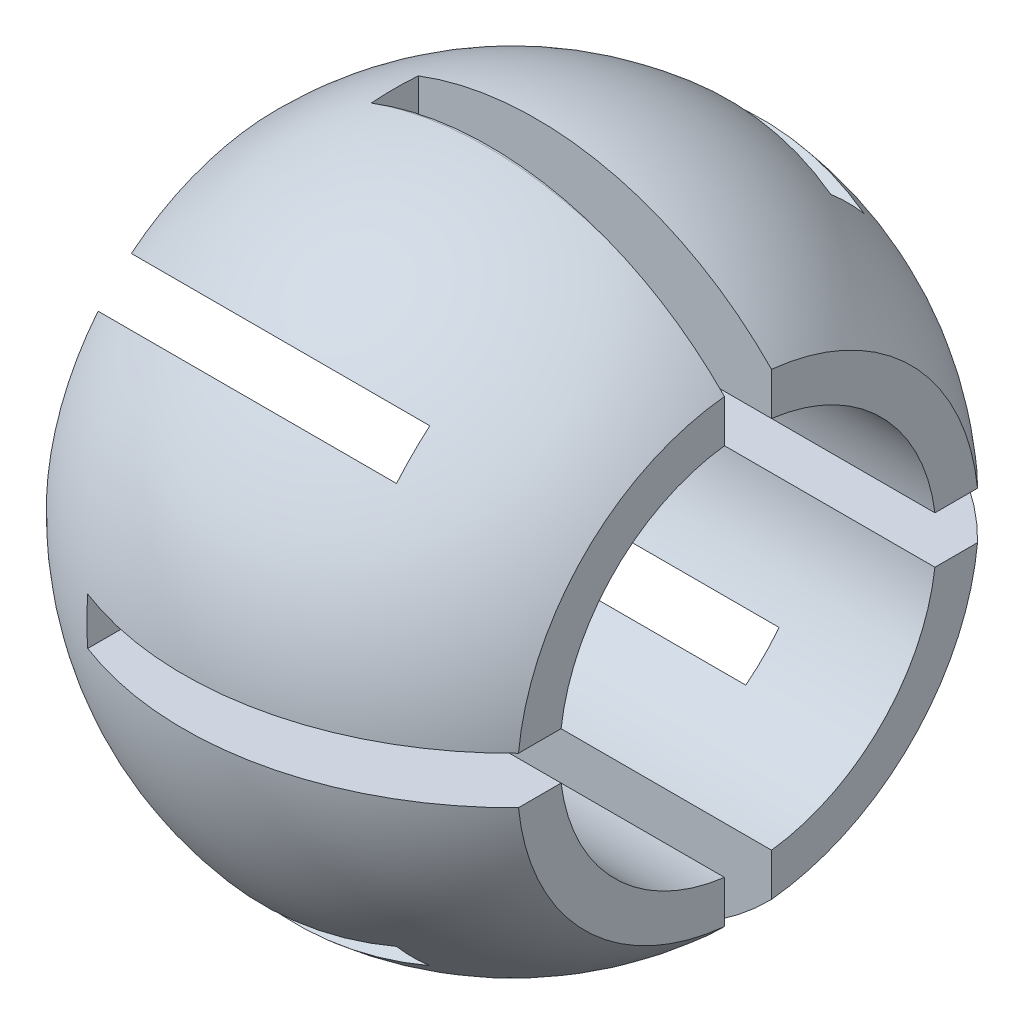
from build123d import *
from build123d.topology import SkipClean

# Parameters (mm, degrees)
SKIZZE2_W               = 7.5
SKIZZE2_H               = 1
LINEAR_AUSTRAGEN1_DEPTH = 12.090536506
KREISMUSTER1_COUNT      = 4
SKIZZE3_W               = 7.5
SKIZZE3_H               = 1
LINEAR_AUSTRAGEN2_DEPTH = 12.067971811
KREISMUSTER2_COUNT      = 4


with BuildPart() as part:
    # Skizze1 → Rotation1 (revolve)
    with BuildSketch(Plane.XY, mode=Mode.PRIVATE) as rotation1_sk:
        with BuildLine():
            Line((-5, 4), (5, 4))
            Line((5, 4), (5, 4.898979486))
            ThreePointArc((5, 4.898979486), (0, 7), (-5, 4.898979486))
            Line((-5, 4.898979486), (-5, 4))
        make_face()
    revolve(rotation1_sk.sketch.rotate(Axis((-5, 0, 0), (1, 0, 0)), 4.385799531), axis=Axis((-5, 0, 0), (1, 0, 0)))

    # Skizze2 → Linear austragen1 (cut, through all)
    with BuildSketch(Plane(origin=(0, 0, 0), x_dir=(1, 0, 0), z_dir=(0, 1, 0))):
        with Locations((1.25, 0)):
            Rectangle(SKIZZE2_W, SKIZZE2_H)
    linear_austragen1 = extrude(amount=-LINEAR_AUSTRAGEN1_DEPTH, mode=Mode.SUBTRACT)

    # Kreismuster1: Linear austragen1 ×4 about axis
    with SkipClean():  # the faces are left unmerged after this step: merging them gives an invalid solid
        kreismuster1_axis = Axis((0, 0, 0), (1, 0, 0))
        for i in range(1, KREISMUSTER1_COUNT):
            add(linear_austragen1.rotate(kreismuster1_axis, i * 360 / KREISMUSTER1_COUNT), mode=Mode.SUBTRACT)

    # Skizze3 → Linear austragen2 (cut, through all)
    with SkipClean():  # the faces are left unmerged after this step: merging them gives an invalid solid
        with BuildSketch(Plane(origin=(0, 0, 0), x_dir=(-1, 0, 0), z_dir=(0, 0.7071067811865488, 0.7071067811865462))):
            with Locations((1.25, 0)):
                Rectangle(SKIZZE3_W, SKIZZE3_H)
        linear_austragen2 = extrude(amount=-LINEAR_AUSTRAGEN2_DEPTH, mode=Mode.SUBTRACT)

    # Kreismuster2: Linear austragen2 ×4 about axis
    with SkipClean():  # the faces are left unmerged after this step: merging them gives an invalid solid
        kreismuster2_axis = Axis((0, 0, 0), (1, 0, 0))
        for i in range(1, KREISMUSTER2_COUNT):
            add(linear_austragen2.rotate(kreismuster2_axis, i * 360 / KREISMUSTER2_COUNT), mode=Mode.SUBTRACT)


solid = part.part
